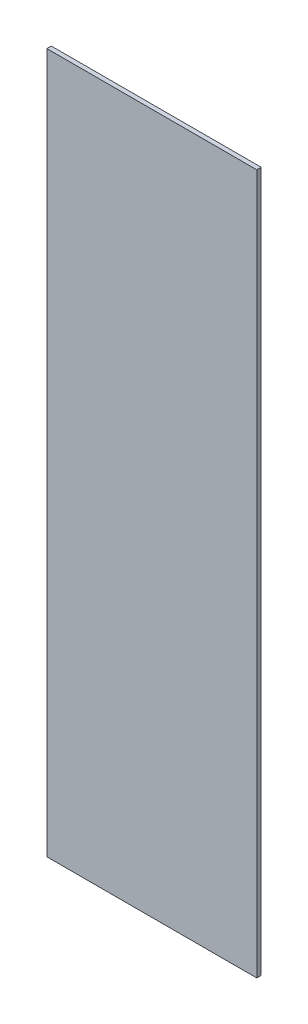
ISO-10303-21;
HEADER;
FILE_DESCRIPTION(('STEP AP214'),'2;1');
FILE_NAME('part.step','',(''),(''),'','','');
FILE_SCHEMA(('AUTOMOTIVE_DESIGN { 1 0 10303 214 1 1 1 1 }'));
ENDSEC;
DATA;
#1=APPLICATION_CONTEXT('core data for automotive mechanical design processes');
#2=APPLICATION_PROTOCOL_DEFINITION('international standard','automotive_design',2000,#1);
#3=PRODUCT_CONTEXT('',#1,'mechanical');
#4=PRODUCT('Part','Part','',(#3));
#5=PRODUCT_RELATED_PRODUCT_CATEGORY('part','',(#4));
#6=PRODUCT_DEFINITION_FORMATION('','',#4);
#7=PRODUCT_DEFINITION_CONTEXT('part definition',#1,'design');
#8=PRODUCT_DEFINITION('design','',#6,#7);
#9=PRODUCT_DEFINITION_SHAPE('','',#8);
#10=(LENGTH_UNIT() NAMED_UNIT(*) SI_UNIT(.MILLI.,.METRE.));
#11=(NAMED_UNIT(*) PLANE_ANGLE_UNIT() SI_UNIT($,.RADIAN.));
#12=(NAMED_UNIT(*) SI_UNIT($,.STERADIAN.) SOLID_ANGLE_UNIT());
#13=UNCERTAINTY_MEASURE_WITH_UNIT(LENGTH_MEASURE(1.E-05),#10,'distance_accuracy_value','');
#14=(GEOMETRIC_REPRESENTATION_CONTEXT(3) GLOBAL_UNCERTAINTY_ASSIGNED_CONTEXT((#13)) GLOBAL_UNIT_ASSIGNED_CONTEXT((#10,
#11,#12)) REPRESENTATION_CONTEXT('',''));
#15=CARTESIAN_POINT('',(0.,0.,0.));
#16=DIRECTION('',(0.,0.,1.));
#17=DIRECTION('',(1.,0.,0.));
#18=AXIS2_PLACEMENT_3D('',#15,#16,#17);
#19=CARTESIAN_POINT('',(38.1,-127.,1.6002));
#20=DIRECTION('',(-1.,0.,0.));
#21=DIRECTION('',(0.,0.,1.));
#22=AXIS2_PLACEMENT_3D('',#19,#20,#21);
#23=PLANE('',#22);
#24=DIRECTION('',(0.,1.,0.));
#25=VECTOR('',#24,1.);
#26=CARTESIAN_POINT('',(38.1,-127.,0.));
#27=LINE('',#26,#25);
#28=CARTESIAN_POINT('',(38.1,-127.,0.));
#29=VERTEX_POINT('',#28);
#30=CARTESIAN_POINT('',(38.1,127.,0.));
#31=VERTEX_POINT('',#30);
#32=EDGE_CURVE('E96',#29,#31,#27,.T.);
#33=ORIENTED_EDGE('',*,*,#32,.T.);
#34=DIRECTION('',(0.,0.,-1.));
#35=VECTOR('',#34,1.);
#36=CARTESIAN_POINT('',(38.1,127.,1.6002));
#37=LINE('',#36,#35);
#38=CARTESIAN_POINT('',(38.1,127.,1.6002));
#39=VERTEX_POINT('',#38);
#40=EDGE_CURVE('E11',#39,#31,#37,.T.);
#41=ORIENTED_EDGE('',*,*,#40,.F.);
#42=DIRECTION('',(0.,1.,0.));
#43=VECTOR('',#42,1.);
#44=CARTESIAN_POINT('',(38.1,-127.,1.6002));
#45=LINE('',#44,#43);
#46=CARTESIAN_POINT('',(38.1,-127.,1.6002));
#47=VERTEX_POINT('',#46);
#48=EDGE_CURVE('E84',#47,#39,#45,.T.);
#49=ORIENTED_EDGE('',*,*,#48,.F.);
#50=DIRECTION('',(0.,0.,-1.));
#51=VECTOR('',#50,1.);
#52=CARTESIAN_POINT('',(38.1,-127.,1.6002));
#53=LINE('',#52,#51);
#54=EDGE_CURVE('E92',#47,#29,#53,.T.);
#55=ORIENTED_EDGE('',*,*,#54,.T.);
#56=EDGE_LOOP('',(#33,#41,#49,#55));
#57=FACE_BOUND('',#56,.T.);
#58=ADVANCED_FACE('F33',(#57),#23,.F.);
#59=CARTESIAN_POINT('',(-38.1,127.,1.6002));
#60=DIRECTION('',(0.,-1.,0.));
#61=DIRECTION('',(0.,0.,-1.));
#62=AXIS2_PLACEMENT_3D('',#59,#60,#61);
#63=PLANE('',#62);
#64=DIRECTION('',(-1.,0.,0.));
#65=VECTOR('',#64,1.);
#66=CARTESIAN_POINT('',(-38.1,127.,0.));
#67=LINE('',#66,#65);
#68=CARTESIAN_POINT('',(-38.1,127.,0.));
#69=VERTEX_POINT('',#68);
#70=EDGE_CURVE('E88',#31,#69,#67,.T.);
#71=ORIENTED_EDGE('',*,*,#70,.T.);
#72=DIRECTION('',(0.,0.,-1.));
#73=VECTOR('',#72,1.);
#74=CARTESIAN_POINT('',(-38.1,127.,1.6002));
#75=LINE('',#74,#73);
#76=CARTESIAN_POINT('',(-38.1,127.,1.6002));
#77=VERTEX_POINT('',#76);
#78=EDGE_CURVE('E41',#77,#69,#75,.T.);
#79=ORIENTED_EDGE('',*,*,#78,.F.);
#80=DIRECTION('',(-1.,0.,0.));
#81=VECTOR('',#80,1.);
#82=CARTESIAN_POINT('',(-38.1,127.,1.6002));
#83=LINE('',#82,#81);
#84=EDGE_CURVE('E79',#39,#77,#83,.T.);
#85=ORIENTED_EDGE('',*,*,#84,.F.);
#86=ORIENTED_EDGE('',*,*,#40,.T.);
#87=EDGE_LOOP('',(#71,#79,#85,#86));
#88=FACE_BOUND('',#87,.T.);
#89=ADVANCED_FACE('F87',(#88),#63,.F.);
#90=CARTESIAN_POINT('',(-38.1,-127.,1.6002));
#91=DIRECTION('',(1.,0.,0.));
#92=DIRECTION('',(0.,0.,-1.));
#93=AXIS2_PLACEMENT_3D('',#90,#91,#92);
#94=PLANE('',#93);
#95=DIRECTION('',(0.,-1.,0.));
#96=VECTOR('',#95,1.);
#97=CARTESIAN_POINT('',(-38.1,-127.,0.));
#98=LINE('',#97,#96);
#99=CARTESIAN_POINT('',(-38.1,-127.,0.));
#100=VERTEX_POINT('',#99);
#101=EDGE_CURVE('E66',#69,#100,#98,.T.);
#102=ORIENTED_EDGE('',*,*,#101,.T.);
#103=DIRECTION('',(0.,0.,-1.));
#104=VECTOR('',#103,1.);
#105=CARTESIAN_POINT('',(-38.1,-127.,1.6002));
#106=LINE('',#105,#104);
#107=CARTESIAN_POINT('',(-38.1,-127.,1.6002));
#108=VERTEX_POINT('',#107);
#109=EDGE_CURVE('E89',#108,#100,#106,.T.);
#110=ORIENTED_EDGE('',*,*,#109,.F.);
#111=DIRECTION('',(0.,-1.,0.));
#112=VECTOR('',#111,1.);
#113=CARTESIAN_POINT('',(-38.1,-127.,1.6002));
#114=LINE('',#113,#112);
#115=EDGE_CURVE('E82',#77,#108,#114,.T.);
#116=ORIENTED_EDGE('',*,*,#115,.F.);
#117=ORIENTED_EDGE('',*,*,#78,.T.);
#118=EDGE_LOOP('',(#102,#110,#116,#117));
#119=FACE_BOUND('',#118,.T.);
#120=ADVANCED_FACE('F90',(#119),#94,.F.);
#121=CARTESIAN_POINT('',(-38.1,-127.,1.6002));
#122=DIRECTION('',(0.,1.,0.));
#123=DIRECTION('',(0.,0.,1.));
#124=AXIS2_PLACEMENT_3D('',#121,#122,#123);
#125=PLANE('',#124);
#126=DIRECTION('',(1.,0.,0.));
#127=VECTOR('',#126,1.);
#128=CARTESIAN_POINT('',(-38.1,-127.,0.));
#129=LINE('',#128,#127);
#130=EDGE_CURVE('E72',#100,#29,#129,.T.);
#131=ORIENTED_EDGE('',*,*,#130,.T.);
#132=ORIENTED_EDGE('',*,*,#54,.F.);
#133=DIRECTION('',(1.,0.,0.));
#134=VECTOR('',#133,1.);
#135=CARTESIAN_POINT('',(-38.1,-127.,1.6002));
#136=LINE('',#135,#134);
#137=EDGE_CURVE('E49',#108,#47,#136,.T.);
#138=ORIENTED_EDGE('',*,*,#137,.F.);
#139=ORIENTED_EDGE('',*,*,#109,.T.);
#140=EDGE_LOOP('',(#131,#132,#138,#139));
#141=FACE_BOUND('',#140,.T.);
#142=ADVANCED_FACE('F103',(#141),#125,.F.);
#143=CARTESIAN_POINT('',(0.,0.,1.6002));
#144=DIRECTION('',(0.,0.,-1.));
#145=DIRECTION('',(-1.,0.,0.));
#146=AXIS2_PLACEMENT_3D('',#143,#144,#145);
#147=PLANE('',#146);
#148=ORIENTED_EDGE('',*,*,#48,.T.);
#149=ORIENTED_EDGE('',*,*,#84,.T.);
#150=ORIENTED_EDGE('',*,*,#115,.T.);
#151=ORIENTED_EDGE('',*,*,#137,.T.);
#152=EDGE_LOOP('',(#148,#149,#150,#151));
#153=FACE_BOUND('',#152,.T.);
#154=ADVANCED_FACE('F80',(#153),#147,.F.);
#155=CARTESIAN_POINT('',(0.,0.,0.));
#156=DIRECTION('',(0.,0.,-1.));
#157=DIRECTION('',(-1.,0.,0.));
#158=AXIS2_PLACEMENT_3D('',#155,#156,#157);
#159=PLANE('',#158);
#160=ORIENTED_EDGE('',*,*,#32,.F.);
#161=ORIENTED_EDGE('',*,*,#130,.F.);
#162=ORIENTED_EDGE('',*,*,#101,.F.);
#163=ORIENTED_EDGE('',*,*,#70,.F.);
#164=EDGE_LOOP('',(#160,#161,#162,#163));
#165=FACE_BOUND('',#164,.T.);
#166=ADVANCED_FACE('F106',(#165),#159,.T.);
#167=CLOSED_SHELL('',(#58,#89,#120,#142,#154,#166));
#168=MANIFOLD_SOLID_BREP('B2',#167);
#169=ADVANCED_BREP_SHAPE_REPRESENTATION('',(#18,#168),#14);
#170=SHAPE_DEFINITION_REPRESENTATION(#9,#169);
ENDSEC;
END-ISO-10303-21;
